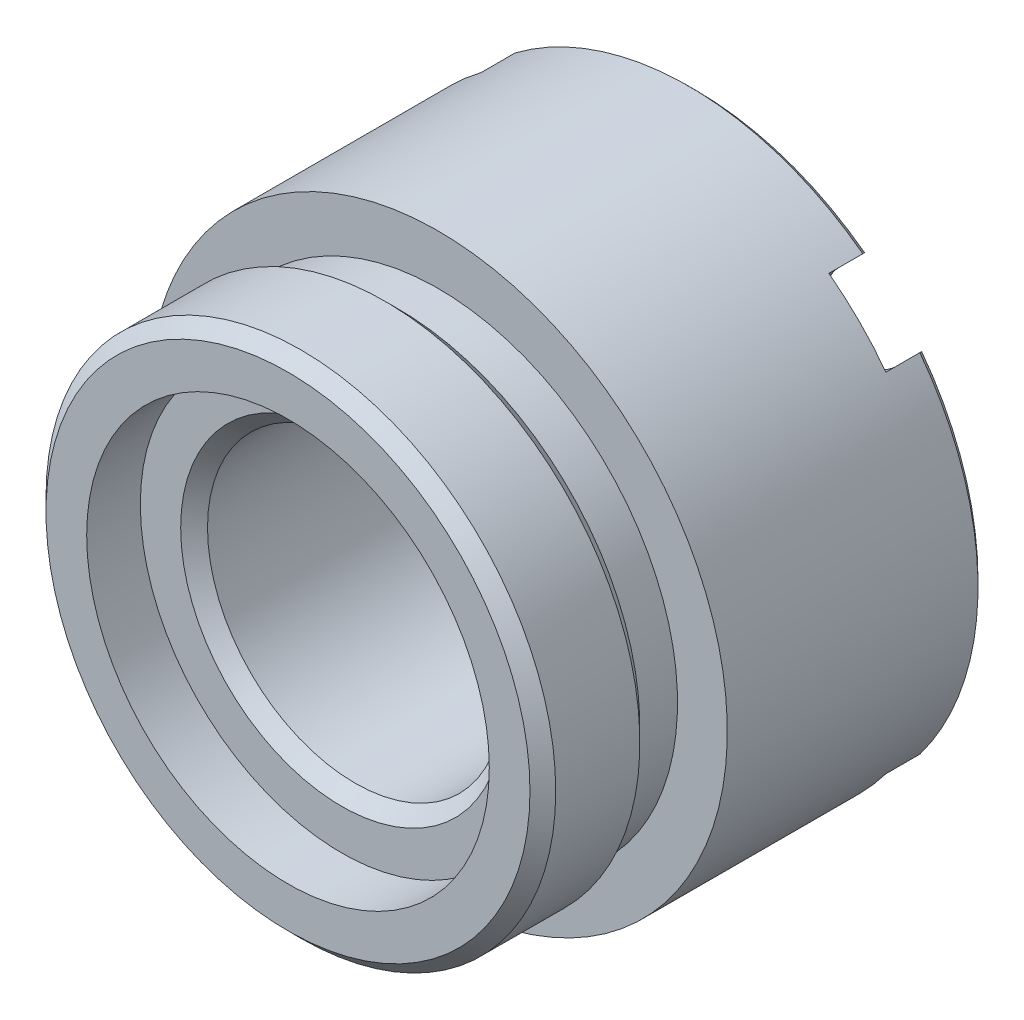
from build123d import *

# Parameters (mm, degrees)
HOLE1_D                 = 23.8252
HOLE1_DEPTH             = 3.175
F_3_4_16_TAPPED_HOLE1_D = 17.4625
CHAMFER1_SIZE           = 0.79375
CHAMFER2_SIZE           = 0.381
CHAMFER3_SIZE           = 0.762
CUT_EXTRUDE1_START      = -2.3876
CUT_EXTRUDE1_DEPTH      = 2.3876
CIRPATTERN1_COUNT       = 4


with BuildPart() as part:
    # Sketch1 → Revolve1 (revolve)
    with BuildSketch(Plane(origin=(0, 0, 0), x_dir=(0, 0, -1), z_dir=(1, 0, 0)), mode=Mode.PRIVATE) as revolve1_sk:
        Polygon((12.0523, 0), (12.0523, 17.1069), (-3.1623, 17.1069), (-3.1623, 14.1605), (-5.5499, 14.1605), (-5.5499, 15.08125), (-12.0523, 15.08125), (-12.0523, 0), align=None)
    revolve(revolve1_sk.sketch.rotate(Axis((0, 0, -63.714165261), (0, 0, 1)), 90), axis=Axis((0, 0, -63.714165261), (0, 0, 1)))

    # Hole1
    with Locations(Plane.XY.offset(12.0523)):
        with Locations((0, 0)):
            Hole(HOLE1_D / 2, depth=HOLE1_DEPTH)

    # 3_4-16 Tapped Hole1 (through all)
    with Locations(Plane.XY.offset(8.8773)):
        with Locations((0, 0)):
            Hole(F_3_4_16_TAPPED_HOLE1_D / 2)

    # Chamfer1
    chamfer1_edges = [part.edges().sort_by_distance(p)[0] for p in [
        (8.73125, 0, 8.8773),
        (8.73125, 0, -12.0523),
    ]]
    chamfer(chamfer1_edges, length=CHAMFER1_SIZE)

    # Chamfer2
    chamfer2_edges = [part.edges().sort_by_distance(p)[0] for p in [
        (17.1069, 0, -12.0523),
    ]]
    chamfer(chamfer2_edges, length=CHAMFER2_SIZE)

    # Chamfer3
    chamfer3_edges = [part.edges().sort_by_distance(p)[0] for p in [
        (15.08125, 0, 12.0523),
        (15.08125, 0, 5.5499),
    ]]
    chamfer(chamfer3_edges, length=CHAMFER3_SIZE)

    # Sketch6 → Cut-Extrude1 (cut)
    with BuildSketch(Plane(origin=(0, 0, -12.0523), x_dir=(-1, 0, 0), z_dir=(0, 0, -1)).offset(CUT_EXTRUDE1_START)):
        with BuildLine():
            Line((10.289720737, 13.666297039), (8.45042101, 11.826997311))
            ThreePointArc((8.45042101, 11.826997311), (8.45042101, 8.45042101), (11.826997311, 8.45042101))
            Line((11.826997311, 8.45042101), (13.666297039, 10.289720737))
            ThreePointArc((13.666297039, 10.289720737), (12.096404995, 12.096404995), (10.289720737, 13.666297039))
        make_face()
    cut_extrude1 = extrude(amount=CUT_EXTRUDE1_DEPTH, mode=Mode.SUBTRACT)

    # CirPattern1: Cut-Extrude1 ×4 about axis
    cirpattern1_axis = Axis((0, 0, 0), (0, 0, 1))
    for i in range(1, CIRPATTERN1_COUNT):
        add(cut_extrude1.rotate(cirpattern1_axis, i * 360 / CIRPATTERN1_COUNT), mode=Mode.SUBTRACT)


solid = part.part
